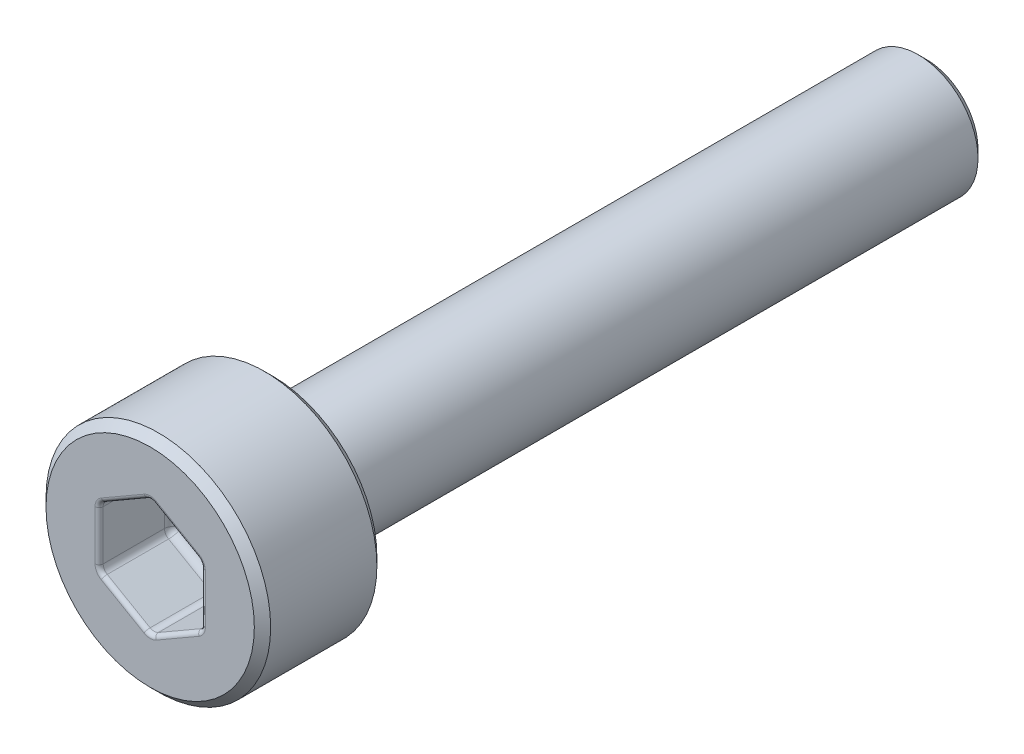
ISO-10303-21;
HEADER;
FILE_DESCRIPTION(('STEP AP214'),'2;1');
FILE_NAME('part.step','',(''),(''),'','','');
FILE_SCHEMA(('AUTOMOTIVE_DESIGN { 1 0 10303 214 1 1 1 1 }'));
ENDSEC;
DATA;
#1=APPLICATION_CONTEXT('core data for automotive mechanical design processes');
#2=APPLICATION_PROTOCOL_DEFINITION('international standard','automotive_design',2000,#1);
#3=PRODUCT_CONTEXT('',#1,'mechanical');
#4=PRODUCT('Part','Part','',(#3));
#5=PRODUCT_RELATED_PRODUCT_CATEGORY('part','',(#4));
#6=PRODUCT_DEFINITION_FORMATION('','',#4);
#7=PRODUCT_DEFINITION_CONTEXT('part definition',#1,'design');
#8=PRODUCT_DEFINITION('design','',#6,#7);
#9=PRODUCT_DEFINITION_SHAPE('','',#8);
#10=(LENGTH_UNIT() NAMED_UNIT(*) SI_UNIT(.MILLI.,.METRE.));
#11=(NAMED_UNIT(*) PLANE_ANGLE_UNIT() SI_UNIT($,.RADIAN.));
#12=(NAMED_UNIT(*) SI_UNIT($,.STERADIAN.) SOLID_ANGLE_UNIT());
#13=UNCERTAINTY_MEASURE_WITH_UNIT(LENGTH_MEASURE(1.E-05),#10,'distance_accuracy_value','');
#14=(GEOMETRIC_REPRESENTATION_CONTEXT(3) GLOBAL_UNCERTAINTY_ASSIGNED_CONTEXT((#13)) GLOBAL_UNIT_ASSIGNED_CONTEXT((#10,
#11,#12)) REPRESENTATION_CONTEXT('',''));
#15=CARTESIAN_POINT('',(0.,0.,0.));
#16=DIRECTION('',(0.,0.,1.));
#17=DIRECTION('',(1.,0.,0.));
#18=AXIS2_PLACEMENT_3D('',#15,#16,#17);
#19=CARTESIAN_POINT('',(0.,0.,3.));
#20=DIRECTION('',(0.,0.,-1.));
#21=DIRECTION('',(-1.,0.,0.));
#22=AXIS2_PLACEMENT_3D('',#19,#20,#21);
#23=PLANE('',#22);
#24=DIRECTION('',(0.,1.,0.));
#25=VECTOR('',#24,1.);
#26=CARTESIAN_POINT('',(1.35,0.,3.));
#27=LINE('',#26,#25);
#28=CARTESIAN_POINT('',(1.35,0.606217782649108,3.));
#29=VERTEX_POINT('',#28);
#30=CARTESIAN_POINT('',(1.35,-0.606217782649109,3.));
#31=VERTEX_POINT('',#30);
#32=EDGE_CURVE('E267',#29,#31,#27,.F.);
#33=ORIENTED_EDGE('',*,*,#32,.T.);
#34=CARTESIAN_POINT('',(1.05,-0.606217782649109,3.));
#35=DIRECTION('',(0.,0.,-1.));
#36=DIRECTION('',(-1.,0.,0.));
#37=AXIS2_PLACEMENT_3D('',#34,#35,#36);
#38=CIRCLE('',#37,0.3);
#39=CARTESIAN_POINT('',(1.2,-0.866025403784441,3.));
#40=VERTEX_POINT('',#39);
#41=EDGE_CURVE('E332',#31,#40,#38,.T.);
#42=ORIENTED_EDGE('',*,*,#41,.T.);
#43=DIRECTION('',(0.866025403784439,0.499999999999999,0.));
#44=VECTOR('',#43,1.);
#45=CARTESIAN_POINT('',(0.675,-1.16913429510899,3.));
#46=LINE('',#45,#44);
#47=CARTESIAN_POINT('',(0.15,-1.47224318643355,3.));
#48=VERTEX_POINT('',#47);
#49=EDGE_CURVE('E330',#40,#48,#46,.F.);
#50=ORIENTED_EDGE('',*,*,#49,.T.);
#51=CARTESIAN_POINT('',(0.,-1.21243556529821,3.));
#52=DIRECTION('',(0.,0.,-1.));
#53=DIRECTION('',(-1.,0.,0.));
#54=AXIS2_PLACEMENT_3D('',#51,#52,#53);
#55=CIRCLE('',#54,0.3);
#56=CARTESIAN_POINT('',(-0.15,-1.47224318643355,3.));
#57=VERTEX_POINT('',#56);
#58=EDGE_CURVE('E328',#48,#57,#55,.T.);
#59=ORIENTED_EDGE('',*,*,#58,.T.);
#60=DIRECTION('',(0.866025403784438,-0.500000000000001,0.));
#61=VECTOR('',#60,1.);
#62=CARTESIAN_POINT('',(-0.675000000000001,-1.16913429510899,3.));
#63=LINE('',#62,#61);
#64=CARTESIAN_POINT('',(-1.2,-0.866025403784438,3.));
#65=VERTEX_POINT('',#64);
#66=EDGE_CURVE('E326',#57,#65,#63,.F.);
#67=ORIENTED_EDGE('',*,*,#66,.T.);
#68=CARTESIAN_POINT('',(-1.05,-0.606217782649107,3.));
#69=DIRECTION('',(0.,0.,-1.));
#70=DIRECTION('',(-1.,0.,0.));
#71=AXIS2_PLACEMENT_3D('',#68,#69,#70);
#72=CIRCLE('',#71,0.3);
#73=CARTESIAN_POINT('',(-1.35,-0.606217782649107,3.));
#74=VERTEX_POINT('',#73);
#75=EDGE_CURVE('E324',#65,#74,#72,.T.);
#76=ORIENTED_EDGE('',*,*,#75,.T.);
#77=DIRECTION('',(0.,-1.,0.));
#78=VECTOR('',#77,1.);
#79=CARTESIAN_POINT('',(-1.35,0.,3.));
#80=LINE('',#79,#78);
#81=CARTESIAN_POINT('',(-1.35,0.606217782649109,3.));
#82=VERTEX_POINT('',#81);
#83=EDGE_CURVE('E322',#74,#82,#80,.F.);
#84=ORIENTED_EDGE('',*,*,#83,.T.);
#85=CARTESIAN_POINT('',(-1.05,0.606217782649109,3.));
#86=DIRECTION('',(0.,0.,-1.));
#87=DIRECTION('',(-1.,0.,0.));
#88=AXIS2_PLACEMENT_3D('',#85,#86,#87);
#89=CIRCLE('',#88,0.3);
#90=CARTESIAN_POINT('',(-1.2,0.86602540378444,3.));
#91=VERTEX_POINT('',#90);
#92=EDGE_CURVE('E320',#82,#91,#89,.T.);
#93=ORIENTED_EDGE('',*,*,#92,.T.);
#94=DIRECTION('',(-0.866025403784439,-0.5,0.));
#95=VECTOR('',#94,1.);
#96=CARTESIAN_POINT('',(-0.675,1.16913429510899,3.));
#97=LINE('',#96,#95);
#98=CARTESIAN_POINT('',(-0.149999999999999,1.47224318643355,3.));
#99=VERTEX_POINT('',#98);
#100=EDGE_CURVE('E318',#91,#99,#97,.F.);
#101=ORIENTED_EDGE('',*,*,#100,.T.);
#102=CARTESIAN_POINT('',(0.,1.21243556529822,3.));
#103=DIRECTION('',(0.,0.,-1.));
#104=DIRECTION('',(-1.,0.,0.));
#105=AXIS2_PLACEMENT_3D('',#102,#103,#104);
#106=CIRCLE('',#105,0.3);
#107=CARTESIAN_POINT('',(0.150000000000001,1.47224318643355,3.));
#108=VERTEX_POINT('',#107);
#109=EDGE_CURVE('E316',#99,#108,#106,.T.);
#110=ORIENTED_EDGE('',*,*,#109,.T.);
#111=DIRECTION('',(-0.866025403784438,0.5,0.));
#112=VECTOR('',#111,1.);
#113=CARTESIAN_POINT('',(0.675000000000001,1.16913429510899,3.));
#114=LINE('',#113,#112);
#115=CARTESIAN_POINT('',(1.2,0.86602540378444,3.));
#116=VERTEX_POINT('',#115);
#117=EDGE_CURVE('E314',#108,#116,#114,.F.);
#118=ORIENTED_EDGE('',*,*,#117,.T.);
#119=CARTESIAN_POINT('',(1.05,0.606217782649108,3.));
#120=DIRECTION('',(0.,0.,-1.));
#121=DIRECTION('',(-1.,0.,0.));
#122=AXIS2_PLACEMENT_3D('',#119,#120,#121);
#123=CIRCLE('',#122,0.3);
#124=EDGE_CURVE('E312',#116,#29,#123,.T.);
#125=ORIENTED_EDGE('',*,*,#124,.T.);
#126=EDGE_LOOP('',(#33,#42,#50,#59,#67,#76,#84,#93,#101,#110,#118,#125));
#127=FACE_BOUND('',#126,.T.);
#128=CARTESIAN_POINT('',(0.,0.,3.));
#129=DIRECTION('',(0.,0.,-1.));
#130=DIRECTION('',(-1.,0.,0.));
#131=AXIS2_PLACEMENT_3D('',#128,#129,#130);
#132=CIRCLE('',#131,2.55000000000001);
#133=CARTESIAN_POINT('',(-2.55000000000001,0.,3.));
#134=VERTEX_POINT('',#133);
#135=EDGE_CURVE('E310',#134,#134,#132,.F.);
#136=ORIENTED_EDGE('',*,*,#135,.T.);
#137=EDGE_LOOP('',(#136));
#138=FACE_BOUND('',#137,.T.);
#139=ADVANCED_FACE('F38',(#127,#138),#23,.F.);
#140=CARTESIAN_POINT('',(0.,0.,21.9198795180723));
#141=DIRECTION('',(0.,0.,1.));
#142=DIRECTION('',(1.,0.,0.));
#143=AXIS2_PLACEMENT_3D('',#140,#141,#142);
#144=CYLINDRICAL_SURFACE('',#143,2.75);
#145=CARTESIAN_POINT('',(0.,0.,2.8));
#146=DIRECTION('',(0.,0.,-1.));
#147=DIRECTION('',(-1.,0.,0.));
#148=AXIS2_PLACEMENT_3D('',#145,#146,#147);
#149=CIRCLE('',#148,2.75);
#150=CARTESIAN_POINT('',(-2.75,0.,2.8));
#151=VERTEX_POINT('',#150);
#152=EDGE_CURVE('E872',#151,#151,#149,.T.);
#153=ORIENTED_EDGE('',*,*,#152,.T.);
#154=EDGE_LOOP('',(#153));
#155=FACE_BOUND('',#154,.T.);
#156=CARTESIAN_POINT('',(0.,0.,0.200000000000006));
#157=DIRECTION('',(0.,0.,1.));
#158=DIRECTION('',(1.,0.,0.));
#159=AXIS2_PLACEMENT_3D('',#156,#157,#158);
#160=CIRCLE('',#159,2.75);
#161=CARTESIAN_POINT('',(2.75,0.,0.200000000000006));
#162=VERTEX_POINT('',#161);
#163=EDGE_CURVE('E877',#162,#162,#160,.T.);
#164=ORIENTED_EDGE('',*,*,#163,.T.);
#165=EDGE_LOOP('',(#164));
#166=FACE_BOUND('',#165,.T.);
#167=ADVANCED_FACE('F431',(#155,#166),#144,.T.);
#168=CARTESIAN_POINT('',(0.,2.75,0.));
#169=DIRECTION('',(0.,0.,1.));
#170=DIRECTION('',(1.,0.,0.));
#171=AXIS2_PLACEMENT_3D('',#168,#169,#170);
#172=PLANE('',#171);
#173=CARTESIAN_POINT('',(0.,0.,0.));
#174=DIRECTION('',(0.,0.,1.));
#175=DIRECTION('',(1.,0.,0.));
#176=AXIS2_PLACEMENT_3D('',#173,#174,#175);
#177=CIRCLE('',#176,1.665);
#178=CARTESIAN_POINT('',(1.665,0.,0.));
#179=VERTEX_POINT('',#178);
#180=EDGE_CURVE('E262',#179,#179,#177,.T.);
#181=ORIENTED_EDGE('',*,*,#180,.T.);
#182=EDGE_LOOP('',(#181));
#183=FACE_BOUND('',#182,.T.);
#184=CARTESIAN_POINT('',(0.,0.,0.));
#185=DIRECTION('',(0.,0.,1.));
#186=DIRECTION('',(1.,0.,0.));
#187=AXIS2_PLACEMENT_3D('',#184,#185,#186);
#188=CIRCLE('',#187,2.54999999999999);
#189=CARTESIAN_POINT('',(2.54999999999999,0.,0.));
#190=VERTEX_POINT('',#189);
#191=EDGE_CURVE('E870',#190,#190,#188,.F.);
#192=ORIENTED_EDGE('',*,*,#191,.T.);
#193=EDGE_LOOP('',(#192));
#194=FACE_BOUND('',#193,.T.);
#195=ADVANCED_FACE('F437',(#183,#194),#172,.F.);
#196=CARTESIAN_POINT('',(0.,0.,21.9198795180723));
#197=DIRECTION('',(0.,0.,1.));
#198=DIRECTION('',(1.,0.,0.));
#199=AXIS2_PLACEMENT_3D('',#196,#197,#198);
#200=CYLINDRICAL_SURFACE('',#199,1.465);
#201=CARTESIAN_POINT('',(0.,0.,-0.200000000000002));
#202=DIRECTION('',(0.,0.,1.));
#203=DIRECTION('',(1.,0.,0.));
#204=AXIS2_PLACEMENT_3D('',#201,#202,#203);
#205=CIRCLE('',#204,1.465);
#206=CARTESIAN_POINT('',(1.465,0.,-0.200000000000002));
#207=VERTEX_POINT('',#206);
#208=EDGE_CURVE('E265',#207,#207,#205,.F.);
#209=ORIENTED_EDGE('',*,*,#208,.T.);
#210=EDGE_LOOP('',(#209));
#211=FACE_BOUND('',#210,.T.);
#212=CARTESIAN_POINT('',(0.,0.,-15.8));
#213=DIRECTION('',(0.,0.,1.));
#214=DIRECTION('',(1.,0.,0.));
#215=AXIS2_PLACEMENT_3D('',#212,#213,#214);
#216=CIRCLE('',#215,1.465);
#217=CARTESIAN_POINT('',(1.465,0.,-15.8));
#218=VERTEX_POINT('',#217);
#219=EDGE_CURVE('E871',#218,#218,#216,.T.);
#220=ORIENTED_EDGE('',*,*,#219,.T.);
#221=EDGE_LOOP('',(#220));
#222=FACE_BOUND('',#221,.T.);
#223=ADVANCED_FACE('F812',(#211,#222),#200,.T.);
#224=CARTESIAN_POINT('',(0.,1.465,-16.));
#225=DIRECTION('',(0.,0.,1.));
#226=DIRECTION('',(1.,0.,0.));
#227=AXIS2_PLACEMENT_3D('',#224,#225,#226);
#228=PLANE('',#227);
#229=CARTESIAN_POINT('',(0.,0.,-16.));
#230=DIRECTION('',(0.,0.,1.));
#231=DIRECTION('',(1.,0.,0.));
#232=AXIS2_PLACEMENT_3D('',#229,#230,#231);
#233=CIRCLE('',#232,1.265);
#234=CARTESIAN_POINT('',(1.265,0.,-16.));
#235=VERTEX_POINT('',#234);
#236=EDGE_CURVE('E212',#235,#235,#233,.F.);
#237=ORIENTED_EDGE('',*,*,#236,.T.);
#238=EDGE_LOOP('',(#237));
#239=FACE_BOUND('',#238,.T.);
#240=ADVANCED_FACE('F804',(#239),#228,.F.);
#241=CARTESIAN_POINT('',(0.,-1.44337567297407,1.2));
#242=DIRECTION('',(0.499999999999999,-0.866025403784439,0.));
#243=DIRECTION('',(0.866025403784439,0.499999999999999,0.));
#244=AXIS2_PLACEMENT_3D('',#241,#242,#243);
#245=PLANE('',#244);
#246=DIRECTION('',(0.,0.,1.));
#247=VECTOR('',#246,1.);
#248=CARTESIAN_POINT('',(0.0999999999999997,-1.3856406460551,3.));
#249=LINE('',#248,#247);
#250=CARTESIAN_POINT('',(0.0999999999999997,-1.3856406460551,1.4));
#251=VERTEX_POINT('',#250);
#252=CARTESIAN_POINT('',(0.0999999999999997,-1.3856406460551,2.9));
#253=VERTEX_POINT('',#252);
#254=EDGE_CURVE('E259',#251,#253,#249,.T.);
#255=ORIENTED_EDGE('',*,*,#254,.T.);
#256=DIRECTION('',(0.866025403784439,0.499999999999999,0.));
#257=VECTOR('',#256,1.);
#258=CARTESIAN_POINT('',(0.,-1.44337567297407,2.9));
#259=LINE('',#258,#257);
#260=CARTESIAN_POINT('',(1.15,-0.779422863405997,2.9));
#261=VERTEX_POINT('',#260);
#262=EDGE_CURVE('E338',#253,#261,#259,.T.);
#263=ORIENTED_EDGE('',*,*,#262,.T.);
#264=DIRECTION('',(0.,0.,1.));
#265=VECTOR('',#264,1.);
#266=CARTESIAN_POINT('',(1.15,-0.779422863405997,1.2));
#267=LINE('',#266,#265);
#268=CARTESIAN_POINT('',(1.15,-0.779422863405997,1.4));
#269=VERTEX_POINT('',#268);
#270=EDGE_CURVE('E255',#261,#269,#267,.F.);
#271=ORIENTED_EDGE('',*,*,#270,.T.);
#272=DIRECTION('',(0.866025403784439,0.499999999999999,0.));
#273=VECTOR('',#272,1.);
#274=CARTESIAN_POINT('',(0.,-1.44337567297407,1.4));
#275=LINE('',#274,#273);
#276=EDGE_CURVE('E257',#269,#251,#275,.F.);
#277=ORIENTED_EDGE('',*,*,#276,.T.);
#278=EDGE_LOOP('',(#255,#263,#271,#277));
#279=FACE_BOUND('',#278,.T.);
#280=ADVANCED_FACE('F795',(#279),#245,.F.);
#281=CARTESIAN_POINT('',(-1.25,-0.721687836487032,1.2));
#282=DIRECTION('',(-0.5,-0.866025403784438,0.));
#283=DIRECTION('',(0.866025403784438,-0.500000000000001,0.));
#284=AXIS2_PLACEMENT_3D('',#281,#282,#283);
#285=PLANE('',#284);
#286=DIRECTION('',(0.,0.,1.));
#287=VECTOR('',#286,1.);
#288=CARTESIAN_POINT('',(-1.15,-0.779422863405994,3.));
#289=LINE('',#288,#287);
#290=CARTESIAN_POINT('',(-1.15,-0.779422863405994,1.4));
#291=VERTEX_POINT('',#290);
#292=CARTESIAN_POINT('',(-1.15,-0.779422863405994,2.9));
#293=VERTEX_POINT('',#292);
#294=EDGE_CURVE('E226',#291,#293,#289,.T.);
#295=ORIENTED_EDGE('',*,*,#294,.T.);
#296=DIRECTION('',(0.866025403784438,-0.500000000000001,0.));
#297=VECTOR('',#296,1.);
#298=CARTESIAN_POINT('',(-1.25,-0.721687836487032,2.9));
#299=LINE('',#298,#297);
#300=CARTESIAN_POINT('',(-0.1,-1.3856406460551,2.9));
#301=VERTEX_POINT('',#300);
#302=EDGE_CURVE('E342',#293,#301,#299,.T.);
#303=ORIENTED_EDGE('',*,*,#302,.T.);
#304=DIRECTION('',(0.,0.,1.));
#305=VECTOR('',#304,1.);
#306=CARTESIAN_POINT('',(-0.1,-1.3856406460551,1.2));
#307=LINE('',#306,#305);
#308=CARTESIAN_POINT('',(-0.1,-1.3856406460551,1.4));
#309=VERTEX_POINT('',#308);
#310=EDGE_CURVE('E218',#301,#309,#307,.F.);
#311=ORIENTED_EDGE('',*,*,#310,.T.);
#312=DIRECTION('',(0.866025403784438,-0.500000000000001,0.));
#313=VECTOR('',#312,1.);
#314=CARTESIAN_POINT('',(-1.25,-0.721687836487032,1.4));
#315=LINE('',#314,#313);
#316=EDGE_CURVE('E189',#309,#291,#315,.F.);
#317=ORIENTED_EDGE('',*,*,#316,.T.);
#318=EDGE_LOOP('',(#295,#303,#311,#317));
#319=FACE_BOUND('',#318,.T.);
#320=ADVANCED_FACE('F787',(#319),#285,.F.);
#321=CARTESIAN_POINT('',(-1.25,0.721687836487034,1.2));
#322=DIRECTION('',(-1.,0.,0.));
#323=DIRECTION('',(0.,-1.,0.));
#324=AXIS2_PLACEMENT_3D('',#321,#322,#323);
#325=PLANE('',#324);
#326=DIRECTION('',(0.,0.,1.));
#327=VECTOR('',#326,1.);
#328=CARTESIAN_POINT('',(-1.25,0.606217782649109,3.));
#329=LINE('',#328,#327);
#330=CARTESIAN_POINT('',(-1.25,0.606217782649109,1.4));
#331=VERTEX_POINT('',#330);
#332=CARTESIAN_POINT('',(-1.25,0.606217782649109,2.9));
#333=VERTEX_POINT('',#332);
#334=EDGE_CURVE('E229',#331,#333,#329,.T.);
#335=ORIENTED_EDGE('',*,*,#334,.T.);
#336=DIRECTION('',(0.,-1.,0.));
#337=VECTOR('',#336,1.);
#338=CARTESIAN_POINT('',(-1.25,0.721687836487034,2.9));
#339=LINE('',#338,#337);
#340=CARTESIAN_POINT('',(-1.25,-0.606217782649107,2.9));
#341=VERTEX_POINT('',#340);
#342=EDGE_CURVE('E346',#333,#341,#339,.T.);
#343=ORIENTED_EDGE('',*,*,#342,.T.);
#344=DIRECTION('',(0.,0.,1.));
#345=VECTOR('',#344,1.);
#346=CARTESIAN_POINT('',(-1.25,-0.606217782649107,1.2));
#347=LINE('',#346,#345);
#348=CARTESIAN_POINT('',(-1.25,-0.606217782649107,1.4));
#349=VERTEX_POINT('',#348);
#350=EDGE_CURVE('E234',#341,#349,#347,.F.);
#351=ORIENTED_EDGE('',*,*,#350,.T.);
#352=DIRECTION('',(0.,-1.,0.));
#353=VECTOR('',#352,1.);
#354=CARTESIAN_POINT('',(-1.25,0.721687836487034,1.4));
#355=LINE('',#354,#353);
#356=EDGE_CURVE('E232',#349,#331,#355,.F.);
#357=ORIENTED_EDGE('',*,*,#356,.T.);
#358=EDGE_LOOP('',(#335,#343,#351,#357));
#359=FACE_BOUND('',#358,.T.);
#360=ADVANCED_FACE('F406',(#359),#325,.F.);
#361=CARTESIAN_POINT('',(0.,1.44337567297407,1.2));
#362=DIRECTION('',(-0.5,0.866025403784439,0.));
#363=DIRECTION('',(-0.866025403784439,-0.5,0.));
#364=AXIS2_PLACEMENT_3D('',#361,#362,#363);
#365=PLANE('',#364);
#366=DIRECTION('',(0.,0.,1.));
#367=VECTOR('',#366,1.);
#368=CARTESIAN_POINT('',(-0.0999999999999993,1.3856406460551,3.));
#369=LINE('',#368,#367);
#370=CARTESIAN_POINT('',(-0.0999999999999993,1.3856406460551,1.4));
#371=VERTEX_POINT('',#370);
#372=CARTESIAN_POINT('',(-0.0999999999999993,1.3856406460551,2.9));
#373=VERTEX_POINT('',#372);
#374=EDGE_CURVE('E240',#371,#373,#369,.T.);
#375=ORIENTED_EDGE('',*,*,#374,.T.);
#376=DIRECTION('',(-0.866025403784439,-0.5,0.));
#377=VECTOR('',#376,1.);
#378=CARTESIAN_POINT('',(0.,1.44337567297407,2.9));
#379=LINE('',#378,#377);
#380=CARTESIAN_POINT('',(-1.15,0.779422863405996,2.9));
#381=VERTEX_POINT('',#380);
#382=EDGE_CURVE('E350',#373,#381,#379,.T.);
#383=ORIENTED_EDGE('',*,*,#382,.T.);
#384=DIRECTION('',(0.,0.,1.));
#385=VECTOR('',#384,1.);
#386=CARTESIAN_POINT('',(-1.15,0.779422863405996,1.2));
#387=LINE('',#386,#385);
#388=CARTESIAN_POINT('',(-1.15,0.779422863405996,1.4));
#389=VERTEX_POINT('',#388);
#390=EDGE_CURVE('E236',#381,#389,#387,.F.);
#391=ORIENTED_EDGE('',*,*,#390,.T.);
#392=DIRECTION('',(-0.866025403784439,-0.5,0.));
#393=VECTOR('',#392,1.);
#394=CARTESIAN_POINT('',(0.,1.44337567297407,1.4));
#395=LINE('',#394,#393);
#396=EDGE_CURVE('E238',#389,#371,#395,.F.);
#397=ORIENTED_EDGE('',*,*,#396,.T.);
#398=EDGE_LOOP('',(#375,#383,#391,#397));
#399=FACE_BOUND('',#398,.T.);
#400=ADVANCED_FACE('F770',(#399),#365,.F.);
#401=CARTESIAN_POINT('',(1.25,0.721687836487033,1.2));
#402=DIRECTION('',(0.5,0.866025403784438,0.));
#403=DIRECTION('',(-0.866025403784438,0.5,0.));
#404=AXIS2_PLACEMENT_3D('',#401,#402,#403);
#405=PLANE('',#404);
#406=DIRECTION('',(0.,0.,1.));
#407=VECTOR('',#406,1.);
#408=CARTESIAN_POINT('',(1.15,0.779422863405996,3.));
#409=LINE('',#408,#407);
#410=CARTESIAN_POINT('',(1.15,0.779422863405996,1.4));
#411=VERTEX_POINT('',#410);
#412=CARTESIAN_POINT('',(1.15,0.779422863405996,2.9));
#413=VERTEX_POINT('',#412);
#414=EDGE_CURVE('E247',#411,#413,#409,.T.);
#415=ORIENTED_EDGE('',*,*,#414,.T.);
#416=DIRECTION('',(-0.866025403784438,0.5,0.));
#417=VECTOR('',#416,1.);
#418=CARTESIAN_POINT('',(1.25,0.721687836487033,2.9));
#419=LINE('',#418,#417);
#420=CARTESIAN_POINT('',(0.100000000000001,1.3856406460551,2.9));
#421=VERTEX_POINT('',#420);
#422=EDGE_CURVE('E354',#413,#421,#419,.T.);
#423=ORIENTED_EDGE('',*,*,#422,.T.);
#424=DIRECTION('',(0.,0.,1.));
#425=VECTOR('',#424,1.);
#426=CARTESIAN_POINT('',(0.100000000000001,1.3856406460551,1.2));
#427=LINE('',#426,#425);
#428=CARTESIAN_POINT('',(0.100000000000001,1.3856406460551,1.4));
#429=VERTEX_POINT('',#428);
#430=EDGE_CURVE('E243',#421,#429,#427,.F.);
#431=ORIENTED_EDGE('',*,*,#430,.T.);
#432=DIRECTION('',(-0.866025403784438,0.5,0.));
#433=VECTOR('',#432,1.);
#434=CARTESIAN_POINT('',(1.25,0.721687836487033,1.4));
#435=LINE('',#434,#433);
#436=EDGE_CURVE('E245',#429,#411,#435,.F.);
#437=ORIENTED_EDGE('',*,*,#436,.T.);
#438=EDGE_LOOP('',(#415,#423,#431,#437));
#439=FACE_BOUND('',#438,.T.);
#440=ADVANCED_FACE('F762',(#439),#405,.F.);
#441=CARTESIAN_POINT('',(1.25,-0.721687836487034,1.2));
#442=DIRECTION('',(1.,0.,0.));
#443=DIRECTION('',(0.,1.,0.));
#444=AXIS2_PLACEMENT_3D('',#441,#442,#443);
#445=PLANE('',#444);
#446=DIRECTION('',(0.,0.,1.));
#447=VECTOR('',#446,1.);
#448=CARTESIAN_POINT('',(1.25,-0.606217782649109,3.));
#449=LINE('',#448,#447);
#450=CARTESIAN_POINT('',(1.25,-0.606217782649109,1.4));
#451=VERTEX_POINT('',#450);
#452=CARTESIAN_POINT('',(1.25,-0.606217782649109,2.9));
#453=VERTEX_POINT('',#452);
#454=EDGE_CURVE('E253',#451,#453,#449,.T.);
#455=ORIENTED_EDGE('',*,*,#454,.T.);
#456=DIRECTION('',(0.,1.,0.));
#457=VECTOR('',#456,1.);
#458=CARTESIAN_POINT('',(1.25,-0.721687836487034,2.9));
#459=LINE('',#458,#457);
#460=CARTESIAN_POINT('',(1.25,0.606217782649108,2.9));
#461=VERTEX_POINT('',#460);
#462=EDGE_CURVE('E11',#453,#461,#459,.T.);
#463=ORIENTED_EDGE('',*,*,#462,.T.);
#464=DIRECTION('',(0.,0.,1.));
#465=VECTOR('',#464,1.);
#466=CARTESIAN_POINT('',(1.25,0.606217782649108,1.2));
#467=LINE('',#466,#465);
#468=CARTESIAN_POINT('',(1.25,0.606217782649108,1.4));
#469=VERTEX_POINT('',#468);
#470=EDGE_CURVE('E249',#461,#469,#467,.F.);
#471=ORIENTED_EDGE('',*,*,#470,.T.);
#472=DIRECTION('',(0.,1.,0.));
#473=VECTOR('',#472,1.);
#474=CARTESIAN_POINT('',(1.25,-0.721687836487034,1.4));
#475=LINE('',#474,#473);
#476=EDGE_CURVE('E251',#469,#451,#475,.F.);
#477=ORIENTED_EDGE('',*,*,#476,.T.);
#478=EDGE_LOOP('',(#455,#463,#471,#477));
#479=FACE_BOUND('',#478,.T.);
#480=ADVANCED_FACE('F754',(#479),#445,.F.);
#481=CARTESIAN_POINT('',(0.,0.,1.2));
#482=DIRECTION('',(0.,0.,1.));
#483=DIRECTION('',(1.,0.,0.));
#484=AXIS2_PLACEMENT_3D('',#481,#482,#483);
#485=PLANE('',#484);
#486=DIRECTION('',(0.,-1.,0.));
#487=VECTOR('',#486,1.);
#488=CARTESIAN_POINT('',(-1.05,0.,1.2));
#489=LINE('',#488,#487);
#490=CARTESIAN_POINT('',(-1.05,0.606217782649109,1.2));
#491=VERTEX_POINT('',#490);
#492=CARTESIAN_POINT('',(-1.05,-0.606217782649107,1.2));
#493=VERTEX_POINT('',#492);
#494=EDGE_CURVE('E216',#491,#493,#489,.T.);
#495=ORIENTED_EDGE('',*,*,#494,.T.);
#496=DIRECTION('',(0.866025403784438,-0.500000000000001,0.));
#497=VECTOR('',#496,1.);
#498=CARTESIAN_POINT('',(-0.525000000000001,-0.909326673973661,1.2));
#499=LINE('',#498,#497);
#500=CARTESIAN_POINT('',(0.,-1.21243556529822,1.2));
#501=VERTEX_POINT('',#500);
#502=EDGE_CURVE('E187',#493,#501,#499,.T.);
#503=ORIENTED_EDGE('',*,*,#502,.T.);
#504=DIRECTION('',(0.866025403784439,0.499999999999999,0.));
#505=VECTOR('',#504,1.);
#506=CARTESIAN_POINT('',(0.525,-0.909326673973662,1.2));
#507=LINE('',#506,#505);
#508=CARTESIAN_POINT('',(1.05,-0.606217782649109,1.2));
#509=VERTEX_POINT('',#508);
#510=EDGE_CURVE('E205',#501,#509,#507,.T.);
#511=ORIENTED_EDGE('',*,*,#510,.T.);
#512=DIRECTION('',(0.,1.,0.));
#513=VECTOR('',#512,1.);
#514=CARTESIAN_POINT('',(1.05,0.,1.2));
#515=LINE('',#514,#513);
#516=CARTESIAN_POINT('',(1.05,0.606217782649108,1.2));
#517=VERTEX_POINT('',#516);
#518=EDGE_CURVE('E211',#509,#517,#515,.T.);
#519=ORIENTED_EDGE('',*,*,#518,.T.);
#520=DIRECTION('',(-0.866025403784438,0.5,0.));
#521=VECTOR('',#520,1.);
#522=CARTESIAN_POINT('',(0.525000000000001,0.909326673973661,1.2));
#523=LINE('',#522,#521);
#524=CARTESIAN_POINT('',(0.,1.21243556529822,1.2));
#525=VERTEX_POINT('',#524);
#526=EDGE_CURVE('E884',#517,#525,#523,.T.);
#527=ORIENTED_EDGE('',*,*,#526,.T.);
#528=DIRECTION('',(-0.866025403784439,-0.5,0.));
#529=VECTOR('',#528,1.);
#530=CARTESIAN_POINT('',(-0.525,0.909326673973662,1.2));
#531=LINE('',#530,#529);
#532=EDGE_CURVE('E221',#525,#491,#531,.T.);
#533=ORIENTED_EDGE('',*,*,#532,.T.);
#534=EDGE_LOOP('',(#495,#503,#511,#519,#527,#533));
#535=FACE_BOUND('',#534,.T.);
#536=ADVANCED_FACE('F214',(#535),#485,.T.);
#537=CARTESIAN_POINT('',(0.,0.,3.));
#538=DIRECTION('',(0.,0.,-1.));
#539=DIRECTION('',(-1.,0.,0.));
#540=AXIS2_PLACEMENT_3D('',#537,#538,#539);
#541=CONICAL_SURFACE('',#540,2.55000000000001,0.785398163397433);
#542=ORIENTED_EDGE('',*,*,#152,.F.);
#543=EDGE_LOOP('',(#542));
#544=FACE_BOUND('',#543,.T.);
#545=ORIENTED_EDGE('',*,*,#135,.F.);
#546=EDGE_LOOP('',(#545));
#547=FACE_BOUND('',#546,.T.);
#548=ADVANCED_FACE('F443',(#544,#547),#541,.T.);
#549=CARTESIAN_POINT('',(0.,0.,0.200000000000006));
#550=DIRECTION('',(0.,0.,1.));
#551=DIRECTION('',(1.,0.,0.));
#552=AXIS2_PLACEMENT_3D('',#549,#550,#551);
#553=CONICAL_SURFACE('',#552,2.75,0.785398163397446);
#554=ORIENTED_EDGE('',*,*,#191,.F.);
#555=EDGE_LOOP('',(#554));
#556=FACE_BOUND('',#555,.T.);
#557=ORIENTED_EDGE('',*,*,#163,.F.);
#558=EDGE_LOOP('',(#557));
#559=FACE_BOUND('',#558,.T.);
#560=ADVANCED_FACE('F446',(#556,#559),#553,.T.);
#561=CARTESIAN_POINT('',(0.,0.,-15.8));
#562=DIRECTION('',(0.,0.,1.));
#563=DIRECTION('',(1.,0.,0.));
#564=AXIS2_PLACEMENT_3D('',#561,#562,#563);
#565=CONICAL_SURFACE('',#564,1.465,0.785398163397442);
#566=ORIENTED_EDGE('',*,*,#236,.F.);
#567=EDGE_LOOP('',(#566));
#568=FACE_BOUND('',#567,.T.);
#569=ORIENTED_EDGE('',*,*,#219,.F.);
#570=EDGE_LOOP('',(#569));
#571=FACE_BOUND('',#570,.T.);
#572=ADVANCED_FACE('F450',(#568,#571),#565,.T.);
#573=CARTESIAN_POINT('',(0.,1.21243556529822,1.2));
#574=DIRECTION('',(0.,0.,-1.));
#575=DIRECTION('',(-1.,0.,0.));
#576=AXIS2_PLACEMENT_3D('',#573,#574,#575);
#577=CYLINDRICAL_SURFACE('',#576,0.2);
#578=ORIENTED_EDGE('',*,*,#430,.F.);
#579=CARTESIAN_POINT('',(0.,1.21243556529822,2.9));
#580=DIRECTION('',(0.,0.,-1.));
#581=DIRECTION('',(-1.,0.,0.));
#582=AXIS2_PLACEMENT_3D('',#579,#580,#581);
#583=CIRCLE('',#582,0.2);
#584=EDGE_CURVE('E352',#421,#373,#583,.F.);
#585=ORIENTED_EDGE('',*,*,#584,.T.);
#586=ORIENTED_EDGE('',*,*,#374,.F.);
#587=CARTESIAN_POINT('',(0.,1.21243556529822,1.4));
#588=DIRECTION('',(0.,0.,1.));
#589=DIRECTION('',(1.,0.,0.));
#590=AXIS2_PLACEMENT_3D('',#587,#588,#589);
#591=CIRCLE('',#590,0.2);
#592=EDGE_CURVE('E307',#429,#371,#591,.T.);
#593=ORIENTED_EDGE('',*,*,#592,.F.);
#594=EDGE_LOOP('',(#578,#585,#586,#593));
#595=FACE_BOUND('',#594,.T.);
#596=ADVANCED_FACE('F454',(#595),#577,.F.);
#597=CARTESIAN_POINT('',(0.525000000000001,0.909326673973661,1.4));
#598=DIRECTION('',(-0.866025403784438,0.5,0.));
#599=DIRECTION('',(-0.5,-0.866025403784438,0.));
#600=AXIS2_PLACEMENT_3D('',#597,#598,#599);
#601=CYLINDRICAL_SURFACE('',#600,0.2);
#602=CARTESIAN_POINT('',(1.05,0.606217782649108,1.4));
#603=DIRECTION('',(-0.866025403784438,0.5,0.));
#604=DIRECTION('',(-0.5,-0.866025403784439,0.));
#605=AXIS2_PLACEMENT_3D('',#602,#603,#604);
#606=CIRCLE('',#605,0.2);
#607=EDGE_CURVE('E301',#411,#517,#606,.T.);
#608=ORIENTED_EDGE('',*,*,#607,.F.);
#609=ORIENTED_EDGE('',*,*,#436,.F.);
#610=CARTESIAN_POINT('',(0.,1.21243556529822,1.4));
#611=DIRECTION('',(0.866025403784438,-0.500000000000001,0.));
#612=DIRECTION('',(0.500000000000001,0.866025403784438,0.));
#613=AXIS2_PLACEMENT_3D('',#610,#611,#612);
#614=CIRCLE('',#613,0.2);
#615=EDGE_CURVE('E304',#525,#429,#614,.T.);
#616=ORIENTED_EDGE('',*,*,#615,.F.);
#617=ORIENTED_EDGE('',*,*,#526,.F.);
#618=EDGE_LOOP('',(#608,#609,#616,#617));
#619=FACE_BOUND('',#618,.T.);
#620=ADVANCED_FACE('F715',(#619),#601,.F.);
#621=CARTESIAN_POINT('',(1.05,0.606217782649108,1.2));
#622=DIRECTION('',(0.,0.,-1.));
#623=DIRECTION('',(-1.,0.,0.));
#624=AXIS2_PLACEMENT_3D('',#621,#622,#623);
#625=CYLINDRICAL_SURFACE('',#624,0.2);
#626=ORIENTED_EDGE('',*,*,#470,.F.);
#627=CARTESIAN_POINT('',(1.05,0.606217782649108,2.9));
#628=DIRECTION('',(0.,0.,-1.));
#629=DIRECTION('',(-1.,0.,0.));
#630=AXIS2_PLACEMENT_3D('',#627,#628,#629);
#631=CIRCLE('',#630,0.2);
#632=EDGE_CURVE('E47',#461,#413,#631,.F.);
#633=ORIENTED_EDGE('',*,*,#632,.T.);
#634=ORIENTED_EDGE('',*,*,#414,.F.);
#635=CARTESIAN_POINT('',(1.05,0.606217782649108,1.4));
#636=DIRECTION('',(0.,0.,1.));
#637=DIRECTION('',(1.,0.,0.));
#638=AXIS2_PLACEMENT_3D('',#635,#636,#637);
#639=CIRCLE('',#638,0.2);
#640=EDGE_CURVE('E298',#469,#411,#639,.T.);
#641=ORIENTED_EDGE('',*,*,#640,.F.);
#642=EDGE_LOOP('',(#626,#633,#634,#641));
#643=FACE_BOUND('',#642,.T.);
#644=ADVANCED_FACE('F706',(#643),#625,.F.);
#645=CARTESIAN_POINT('',(0.,1.21243556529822,1.4));
#646=DIRECTION('',(0.,0.,1.));
#647=DIRECTION('',(1.,0.,0.));
#648=AXIS2_PLACEMENT_3D('',#645,#646,#647);
#649=SPHERICAL_SURFACE('',#648,0.2);
#650=ORIENTED_EDGE('',*,*,#615,.T.);
#651=ORIENTED_EDGE('',*,*,#592,.T.);
#652=CARTESIAN_POINT('',(0.,1.21243556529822,1.4));
#653=DIRECTION('',(-0.866025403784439,-0.5,0.));
#654=DIRECTION('',(0.5,-0.866025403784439,0.));
#655=AXIS2_PLACEMENT_3D('',#652,#653,#654);
#656=CIRCLE('',#655,0.2);
#657=EDGE_CURVE('E295',#525,#371,#656,.F.);
#658=ORIENTED_EDGE('',*,*,#657,.F.);
#659=EDGE_LOOP('',(#650,#651,#658));
#660=FACE_BOUND('',#659,.T.);
#661=ADVANCED_FACE('F697',(#660),#649,.F.);
#662=CARTESIAN_POINT('',(1.05,0.606217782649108,1.4));
#663=DIRECTION('',(0.,0.,1.));
#664=DIRECTION('',(1.,0.,0.));
#665=AXIS2_PLACEMENT_3D('',#662,#663,#664);
#666=SPHERICAL_SURFACE('',#665,0.2);
#667=ORIENTED_EDGE('',*,*,#640,.T.);
#668=ORIENTED_EDGE('',*,*,#607,.T.);
#669=CARTESIAN_POINT('',(1.05,0.606217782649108,1.4));
#670=DIRECTION('',(0.,-1.,0.));
#671=DIRECTION('',(0.,0.,-1.));
#672=AXIS2_PLACEMENT_3D('',#669,#670,#671);
#673=CIRCLE('',#672,0.2);
#674=EDGE_CURVE('E292',#469,#517,#673,.F.);
#675=ORIENTED_EDGE('',*,*,#674,.F.);
#676=EDGE_LOOP('',(#667,#668,#675));
#677=FACE_BOUND('',#676,.T.);
#678=ADVANCED_FACE('F689',(#677),#666,.F.);
#679=CARTESIAN_POINT('',(-1.05,0.606217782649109,1.2));
#680=DIRECTION('',(0.,0.,-1.));
#681=DIRECTION('',(-1.,0.,0.));
#682=AXIS2_PLACEMENT_3D('',#679,#680,#681);
#683=CYLINDRICAL_SURFACE('',#682,0.2);
#684=ORIENTED_EDGE('',*,*,#390,.F.);
#685=CARTESIAN_POINT('',(-1.05,0.606217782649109,2.9));
#686=DIRECTION('',(0.,0.,-1.));
#687=DIRECTION('',(-1.,0.,0.));
#688=AXIS2_PLACEMENT_3D('',#685,#686,#687);
#689=CIRCLE('',#688,0.2);
#690=EDGE_CURVE('E348',#381,#333,#689,.F.);
#691=ORIENTED_EDGE('',*,*,#690,.T.);
#692=ORIENTED_EDGE('',*,*,#334,.F.);
#693=CARTESIAN_POINT('',(-1.05,0.606217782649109,1.4));
#694=DIRECTION('',(0.,0.,1.));
#695=DIRECTION('',(1.,0.,0.));
#696=AXIS2_PLACEMENT_3D('',#693,#694,#695);
#697=CIRCLE('',#696,0.2);
#698=EDGE_CURVE('E289',#389,#331,#697,.T.);
#699=ORIENTED_EDGE('',*,*,#698,.F.);
#700=EDGE_LOOP('',(#684,#691,#692,#699));
#701=FACE_BOUND('',#700,.T.);
#702=ADVANCED_FACE('F403',(#701),#683,.F.);
#703=CARTESIAN_POINT('',(-0.525,0.909326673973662,1.4));
#704=DIRECTION('',(-0.866025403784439,-0.5,0.));
#705=DIRECTION('',(0.5,-0.866025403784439,0.));
#706=AXIS2_PLACEMENT_3D('',#703,#704,#705);
#707=CYLINDRICAL_SURFACE('',#706,0.2);
#708=ORIENTED_EDGE('',*,*,#657,.T.);
#709=ORIENTED_EDGE('',*,*,#396,.F.);
#710=CARTESIAN_POINT('',(-1.05,0.606217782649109,1.4));
#711=DIRECTION('',(0.866025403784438,0.5,0.));
#712=DIRECTION('',(-0.5,0.866025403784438,0.));
#713=AXIS2_PLACEMENT_3D('',#710,#711,#712);
#714=CIRCLE('',#713,0.2);
#715=EDGE_CURVE('E286',#491,#389,#714,.T.);
#716=ORIENTED_EDGE('',*,*,#715,.F.);
#717=ORIENTED_EDGE('',*,*,#532,.F.);
#718=EDGE_LOOP('',(#708,#709,#716,#717));
#719=FACE_BOUND('',#718,.T.);
#720=ADVANCED_FACE('F672',(#719),#707,.F.);
#721=CARTESIAN_POINT('',(1.05,0.,1.4));
#722=DIRECTION('',(0.,1.,0.));
#723=DIRECTION('',(-1.,0.,0.));
#724=AXIS2_PLACEMENT_3D('',#721,#722,#723);
#725=CYLINDRICAL_SURFACE('',#724,0.2);
#726=ORIENTED_EDGE('',*,*,#674,.T.);
#727=ORIENTED_EDGE('',*,*,#518,.F.);
#728=CARTESIAN_POINT('',(1.05,-0.606217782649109,1.4));
#729=DIRECTION('',(0.,1.,0.));
#730=DIRECTION('',(0.,0.,1.));
#731=AXIS2_PLACEMENT_3D('',#728,#729,#730);
#732=CIRCLE('',#731,0.2);
#733=EDGE_CURVE('E283',#451,#509,#732,.T.);
#734=ORIENTED_EDGE('',*,*,#733,.F.);
#735=ORIENTED_EDGE('',*,*,#476,.F.);
#736=EDGE_LOOP('',(#726,#727,#734,#735));
#737=FACE_BOUND('',#736,.T.);
#738=ADVANCED_FACE('F663',(#737),#725,.F.);
#739=CARTESIAN_POINT('',(1.05,-0.606217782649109,1.2));
#740=DIRECTION('',(0.,0.,-1.));
#741=DIRECTION('',(-1.,0.,0.));
#742=AXIS2_PLACEMENT_3D('',#739,#740,#741);
#743=CYLINDRICAL_SURFACE('',#742,0.2);
#744=ORIENTED_EDGE('',*,*,#270,.F.);
#745=CARTESIAN_POINT('',(1.05,-0.606217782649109,2.9));
#746=DIRECTION('',(0.,0.,-1.));
#747=DIRECTION('',(-1.,0.,0.));
#748=AXIS2_PLACEMENT_3D('',#745,#746,#747);
#749=CIRCLE('',#748,0.2);
#750=EDGE_CURVE('E335',#261,#453,#749,.F.);
#751=ORIENTED_EDGE('',*,*,#750,.T.);
#752=ORIENTED_EDGE('',*,*,#454,.F.);
#753=CARTESIAN_POINT('',(1.05,-0.606217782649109,1.4));
#754=DIRECTION('',(0.,0.,1.));
#755=DIRECTION('',(1.,0.,0.));
#756=AXIS2_PLACEMENT_3D('',#753,#754,#755);
#757=CIRCLE('',#756,0.2);
#758=EDGE_CURVE('E280',#269,#451,#757,.T.);
#759=ORIENTED_EDGE('',*,*,#758,.F.);
#760=EDGE_LOOP('',(#744,#751,#752,#759));
#761=FACE_BOUND('',#760,.T.);
#762=ADVANCED_FACE('F654',(#761),#743,.F.);
#763=CARTESIAN_POINT('',(-1.05,0.606217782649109,1.4));
#764=DIRECTION('',(0.,0.,1.));
#765=DIRECTION('',(1.,0.,0.));
#766=AXIS2_PLACEMENT_3D('',#763,#764,#765);
#767=SPHERICAL_SURFACE('',#766,0.2);
#768=ORIENTED_EDGE('',*,*,#715,.T.);
#769=ORIENTED_EDGE('',*,*,#698,.T.);
#770=CARTESIAN_POINT('',(-1.05,0.606217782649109,1.4));
#771=DIRECTION('',(0.,-1.,0.));
#772=DIRECTION('',(0.,0.,-1.));
#773=AXIS2_PLACEMENT_3D('',#770,#771,#772);
#774=CIRCLE('',#773,0.2);
#775=EDGE_CURVE('E277',#491,#331,#774,.F.);
#776=ORIENTED_EDGE('',*,*,#775,.F.);
#777=EDGE_LOOP('',(#768,#769,#776));
#778=FACE_BOUND('',#777,.T.);
#779=ADVANCED_FACE('F645',(#778),#767,.F.);
#780=CARTESIAN_POINT('',(1.05,-0.606217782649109,1.4));
#781=DIRECTION('',(0.,0.,1.));
#782=DIRECTION('',(1.,0.,0.));
#783=AXIS2_PLACEMENT_3D('',#780,#781,#782);
#784=SPHERICAL_SURFACE('',#783,0.2);
#785=ORIENTED_EDGE('',*,*,#758,.T.);
#786=ORIENTED_EDGE('',*,*,#733,.T.);
#787=CARTESIAN_POINT('',(1.05,-0.606217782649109,1.4));
#788=DIRECTION('',(-0.866025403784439,-0.5,0.));
#789=DIRECTION('',(0.5,-0.866025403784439,0.));
#790=AXIS2_PLACEMENT_3D('',#787,#788,#789);
#791=CIRCLE('',#790,0.2);
#792=EDGE_CURVE('E208',#269,#509,#791,.F.);
#793=ORIENTED_EDGE('',*,*,#792,.F.);
#794=EDGE_LOOP('',(#785,#786,#793));
#795=FACE_BOUND('',#794,.T.);
#796=ADVANCED_FACE('F637',(#795),#784,.F.);
#797=CARTESIAN_POINT('',(-1.05,-0.606217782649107,1.2));
#798=DIRECTION('',(0.,0.,-1.));
#799=DIRECTION('',(-1.,0.,0.));
#800=AXIS2_PLACEMENT_3D('',#797,#798,#799);
#801=CYLINDRICAL_SURFACE('',#800,0.2);
#802=ORIENTED_EDGE('',*,*,#350,.F.);
#803=CARTESIAN_POINT('',(-1.05,-0.606217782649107,2.9));
#804=DIRECTION('',(0.,0.,-1.));
#805=DIRECTION('',(-1.,0.,0.));
#806=AXIS2_PLACEMENT_3D('',#803,#804,#805);
#807=CIRCLE('',#806,0.2);
#808=EDGE_CURVE('E344',#341,#293,#807,.F.);
#809=ORIENTED_EDGE('',*,*,#808,.T.);
#810=ORIENTED_EDGE('',*,*,#294,.F.);
#811=CARTESIAN_POINT('',(-1.05,-0.606217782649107,1.4));
#812=DIRECTION('',(0.,0.,1.));
#813=DIRECTION('',(1.,0.,0.));
#814=AXIS2_PLACEMENT_3D('',#811,#812,#813);
#815=CIRCLE('',#814,0.2);
#816=EDGE_CURVE('E273',#349,#291,#815,.T.);
#817=ORIENTED_EDGE('',*,*,#816,.F.);
#818=EDGE_LOOP('',(#802,#809,#810,#817));
#819=FACE_BOUND('',#818,.T.);
#820=ADVANCED_FACE('F416',(#819),#801,.F.);
#821=CARTESIAN_POINT('',(-1.05,0.,1.4));
#822=DIRECTION('',(0.,-1.,0.));
#823=DIRECTION('',(1.,0.,0.));
#824=AXIS2_PLACEMENT_3D('',#821,#822,#823);
#825=CYLINDRICAL_SURFACE('',#824,0.2);
#826=ORIENTED_EDGE('',*,*,#775,.T.);
#827=ORIENTED_EDGE('',*,*,#356,.F.);
#828=CARTESIAN_POINT('',(-1.05,-0.606217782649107,1.4));
#829=DIRECTION('',(0.,1.,0.));
#830=DIRECTION('',(-1.,0.,0.));
#831=AXIS2_PLACEMENT_3D('',#828,#829,#830);
#832=CIRCLE('',#831,0.2);
#833=EDGE_CURVE('E202',#493,#349,#832,.T.);
#834=ORIENTED_EDGE('',*,*,#833,.F.);
#835=ORIENTED_EDGE('',*,*,#494,.F.);
#836=EDGE_LOOP('',(#826,#827,#834,#835));
#837=FACE_BOUND('',#836,.T.);
#838=ADVANCED_FACE('F411',(#837),#825,.F.);
#839=CARTESIAN_POINT('',(0.525,-0.909326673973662,1.4));
#840=DIRECTION('',(0.866025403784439,0.499999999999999,0.));
#841=DIRECTION('',(-0.499999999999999,0.866025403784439,0.));
#842=AXIS2_PLACEMENT_3D('',#839,#840,#841);
#843=CYLINDRICAL_SURFACE('',#842,0.2);
#844=ORIENTED_EDGE('',*,*,#792,.T.);
#845=ORIENTED_EDGE('',*,*,#510,.F.);
#846=CARTESIAN_POINT('',(0.,-1.21243556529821,1.4));
#847=DIRECTION('',(0.866025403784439,0.499999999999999,0.));
#848=DIRECTION('',(-0.499999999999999,0.866025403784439,0.));
#849=AXIS2_PLACEMENT_3D('',#846,#847,#848);
#850=CIRCLE('',#849,0.2);
#851=EDGE_CURVE('E195',#251,#501,#850,.T.);
#852=ORIENTED_EDGE('',*,*,#851,.F.);
#853=ORIENTED_EDGE('',*,*,#276,.F.);
#854=EDGE_LOOP('',(#844,#845,#852,#853));
#855=FACE_BOUND('',#854,.T.);
#856=ADVANCED_FACE('F206',(#855),#843,.F.);
#857=CARTESIAN_POINT('',(0.,-1.21243556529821,1.2));
#858=DIRECTION('',(0.,0.,-1.));
#859=DIRECTION('',(-1.,0.,0.));
#860=AXIS2_PLACEMENT_3D('',#857,#858,#859);
#861=CYLINDRICAL_SURFACE('',#860,0.2);
#862=ORIENTED_EDGE('',*,*,#310,.F.);
#863=CARTESIAN_POINT('',(0.,-1.21243556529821,2.9));
#864=DIRECTION('',(0.,0.,-1.));
#865=DIRECTION('',(-1.,0.,0.));
#866=AXIS2_PLACEMENT_3D('',#863,#864,#865);
#867=CIRCLE('',#866,0.2);
#868=EDGE_CURVE('E340',#301,#253,#867,.F.);
#869=ORIENTED_EDGE('',*,*,#868,.T.);
#870=ORIENTED_EDGE('',*,*,#254,.F.);
#871=CARTESIAN_POINT('',(0.,-1.21243556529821,1.4));
#872=DIRECTION('',(0.,0.,1.));
#873=DIRECTION('',(1.,0.,0.));
#874=AXIS2_PLACEMENT_3D('',#871,#872,#873);
#875=CIRCLE('',#874,0.2);
#876=EDGE_CURVE('E199',#309,#251,#875,.T.);
#877=ORIENTED_EDGE('',*,*,#876,.F.);
#878=EDGE_LOOP('',(#862,#869,#870,#877));
#879=FACE_BOUND('',#878,.T.);
#880=ADVANCED_FACE('F421',(#879),#861,.F.);
#881=CARTESIAN_POINT('',(-1.05,-0.606217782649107,1.4));
#882=DIRECTION('',(0.,0.,1.));
#883=DIRECTION('',(1.,0.,0.));
#884=AXIS2_PLACEMENT_3D('',#881,#882,#883);
#885=SPHERICAL_SURFACE('',#884,0.2);
#886=ORIENTED_EDGE('',*,*,#833,.T.);
#887=ORIENTED_EDGE('',*,*,#816,.T.);
#888=CARTESIAN_POINT('',(-1.05,-0.606217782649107,1.4));
#889=DIRECTION('',(0.866025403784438,-0.5,0.));
#890=DIRECTION('',(0.5,0.866025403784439,0.));
#891=AXIS2_PLACEMENT_3D('',#888,#889,#890);
#892=CIRCLE('',#891,0.2);
#893=EDGE_CURVE('E192',#493,#291,#892,.F.);
#894=ORIENTED_EDGE('',*,*,#893,.F.);
#895=EDGE_LOOP('',(#886,#887,#894));
#896=FACE_BOUND('',#895,.T.);
#897=ADVANCED_FACE('F419',(#896),#885,.F.);
#898=CARTESIAN_POINT('',(0.,-1.21243556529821,1.4));
#899=DIRECTION('',(0.,0.,1.));
#900=DIRECTION('',(1.,0.,0.));
#901=AXIS2_PLACEMENT_3D('',#898,#899,#900);
#902=SPHERICAL_SURFACE('',#901,0.2);
#903=ORIENTED_EDGE('',*,*,#876,.T.);
#904=ORIENTED_EDGE('',*,*,#851,.T.);
#905=CARTESIAN_POINT('',(0.,-1.21243556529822,1.4));
#906=DIRECTION('',(-0.866025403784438,0.500000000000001,0.));
#907=DIRECTION('',(-0.500000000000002,-0.866025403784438,0.));
#908=AXIS2_PLACEMENT_3D('',#905,#906,#907);
#909=CIRCLE('',#908,0.2);
#910=EDGE_CURVE('E183',#309,#501,#909,.F.);
#911=ORIENTED_EDGE('',*,*,#910,.F.);
#912=EDGE_LOOP('',(#903,#904,#911));
#913=FACE_BOUND('',#912,.T.);
#914=ADVANCED_FACE('F197',(#913),#902,.F.);
#915=CARTESIAN_POINT('',(-0.525000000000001,-0.909326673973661,1.4));
#916=DIRECTION('',(0.866025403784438,-0.500000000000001,0.));
#917=DIRECTION('',(0.500000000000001,0.866025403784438,0.));
#918=AXIS2_PLACEMENT_3D('',#915,#916,#917);
#919=CYLINDRICAL_SURFACE('',#918,0.2);
#920=ORIENTED_EDGE('',*,*,#893,.T.);
#921=ORIENTED_EDGE('',*,*,#316,.F.);
#922=ORIENTED_EDGE('',*,*,#910,.T.);
#923=ORIENTED_EDGE('',*,*,#502,.F.);
#924=EDGE_LOOP('',(#920,#921,#922,#923));
#925=FACE_BOUND('',#924,.T.);
#926=ADVANCED_FACE('F185',(#925),#919,.F.);
#927=CARTESIAN_POINT('',(0.,0.,-0.200000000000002));
#928=DIRECTION('',(0.,0.,1.));
#929=DIRECTION('',(1.,0.,0.));
#930=AXIS2_PLACEMENT_3D('',#927,#928,#929);
#931=TOROIDAL_SURFACE('',#930,1.665,0.2);
#932=ORIENTED_EDGE('',*,*,#208,.F.);
#933=EDGE_LOOP('',(#932));
#934=FACE_BOUND('',#933,.T.);
#935=ORIENTED_EDGE('',*,*,#180,.F.);
#936=EDGE_LOOP('',(#935));
#937=FACE_BOUND('',#936,.T.);
#938=ADVANCED_FACE('F457',(#934,#937),#931,.F.);
#939=CARTESIAN_POINT('',(-1.05,0.606217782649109,2.9));
#940=DIRECTION('',(0.,0.,-1.));
#941=DIRECTION('',(-1.,0.,0.));
#942=AXIS2_PLACEMENT_3D('',#939,#940,#941);
#943=TOROIDAL_SURFACE('',#942,0.3,0.1);
#944=CARTESIAN_POINT('',(-1.35,0.606217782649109,2.9));
#945=DIRECTION('',(0.,-1.,0.));
#946=DIRECTION('',(0.,0.,-1.));
#947=AXIS2_PLACEMENT_3D('',#944,#945,#946);
#948=CIRCLE('',#947,0.1);
#949=EDGE_CURVE('E384',#333,#82,#948,.T.);
#950=ORIENTED_EDGE('',*,*,#949,.F.);
#951=ORIENTED_EDGE('',*,*,#690,.F.);
#952=CARTESIAN_POINT('',(-1.2,0.86602540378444,2.9));
#953=DIRECTION('',(0.866025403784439,0.499999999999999,0.));
#954=DIRECTION('',(-0.499999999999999,0.866025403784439,0.));
#955=AXIS2_PLACEMENT_3D('',#952,#953,#954);
#956=CIRCLE('',#955,0.1);
#957=EDGE_CURVE('E42',#91,#381,#956,.T.);
#958=ORIENTED_EDGE('',*,*,#957,.F.);
#959=ORIENTED_EDGE('',*,*,#92,.F.);
#960=EDGE_LOOP('',(#950,#951,#958,#959));
#961=FACE_BOUND('',#960,.T.);
#962=ADVANCED_FACE('F40',(#961),#943,.T.);
#963=CARTESIAN_POINT('',(-0.0499999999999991,1.52997821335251,2.9));
#964=DIRECTION('',(-0.866025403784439,-0.5,0.));
#965=DIRECTION('',(0.5,-0.866025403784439,0.));
#966=AXIS2_PLACEMENT_3D('',#963,#964,#965);
#967=CYLINDRICAL_SURFACE('',#966,0.1);
#968=ORIENTED_EDGE('',*,*,#957,.T.);
#969=ORIENTED_EDGE('',*,*,#382,.F.);
#970=CARTESIAN_POINT('',(-0.149999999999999,1.47224318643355,2.9));
#971=DIRECTION('',(0.866025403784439,0.5,0.));
#972=DIRECTION('',(-0.5,0.866025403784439,0.));
#973=AXIS2_PLACEMENT_3D('',#970,#971,#972);
#974=CIRCLE('',#973,0.1);
#975=EDGE_CURVE('E382',#99,#373,#974,.T.);
#976=ORIENTED_EDGE('',*,*,#975,.F.);
#977=ORIENTED_EDGE('',*,*,#100,.F.);
#978=EDGE_LOOP('',(#968,#969,#976,#977));
#979=FACE_BOUND('',#978,.T.);
#980=ADVANCED_FACE('F395',(#979),#967,.T.);
#981=CARTESIAN_POINT('',(-1.35,0.721687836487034,2.9));
#982=DIRECTION('',(0.,-1.,0.));
#983=DIRECTION('',(1.,0.,0.));
#984=AXIS2_PLACEMENT_3D('',#981,#982,#983);
#985=CYLINDRICAL_SURFACE('',#984,0.1);
#986=ORIENTED_EDGE('',*,*,#949,.T.);
#987=ORIENTED_EDGE('',*,*,#83,.F.);
#988=CARTESIAN_POINT('',(-1.35,-0.606217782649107,2.9));
#989=DIRECTION('',(0.,-1.,0.));
#990=DIRECTION('',(0.,0.,-1.));
#991=AXIS2_PLACEMENT_3D('',#988,#989,#990);
#992=CIRCLE('',#991,0.1);
#993=EDGE_CURVE('E379',#341,#74,#992,.T.);
#994=ORIENTED_EDGE('',*,*,#993,.F.);
#995=ORIENTED_EDGE('',*,*,#342,.F.);
#996=EDGE_LOOP('',(#986,#987,#994,#995));
#997=FACE_BOUND('',#996,.T.);
#998=ADVANCED_FACE('F506',(#997),#985,.T.);
#999=CARTESIAN_POINT('',(0.,1.21243556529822,2.9));
#1000=DIRECTION('',(0.,0.,-1.));
#1001=DIRECTION('',(-1.,0.,0.));
#1002=AXIS2_PLACEMENT_3D('',#999,#1000,#1001);
#1003=TOROIDAL_SURFACE('',#1002,0.3,0.1);
#1004=ORIENTED_EDGE('',*,*,#975,.T.);
#1005=ORIENTED_EDGE('',*,*,#584,.F.);
#1006=CARTESIAN_POINT('',(0.150000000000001,1.47224318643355,2.9));
#1007=DIRECTION('',(0.866025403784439,-0.5,0.));
#1008=DIRECTION('',(0.5,0.866025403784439,0.));
#1009=AXIS2_PLACEMENT_3D('',#1006,#1007,#1008);
#1010=CIRCLE('',#1009,0.1);
#1011=EDGE_CURVE('E376',#108,#421,#1010,.T.);
#1012=ORIENTED_EDGE('',*,*,#1011,.F.);
#1013=ORIENTED_EDGE('',*,*,#109,.F.);
#1014=EDGE_LOOP('',(#1004,#1005,#1012,#1013));
#1015=FACE_BOUND('',#1014,.T.);
#1016=ADVANCED_FACE('F502',(#1015),#1003,.T.);
#1017=CARTESIAN_POINT('',(-1.05,-0.606217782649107,2.9));
#1018=DIRECTION('',(0.,0.,-1.));
#1019=DIRECTION('',(-1.,0.,0.));
#1020=AXIS2_PLACEMENT_3D('',#1017,#1018,#1019);
#1021=TOROIDAL_SURFACE('',#1020,0.3,0.1);
#1022=ORIENTED_EDGE('',*,*,#993,.T.);
#1023=ORIENTED_EDGE('',*,*,#75,.F.);
#1024=CARTESIAN_POINT('',(-1.2,-0.866025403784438,2.9));
#1025=DIRECTION('',(0.866025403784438,-0.500000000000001,0.));
#1026=DIRECTION('',(0.500000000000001,0.866025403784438,0.));
#1027=AXIS2_PLACEMENT_3D('',#1024,#1025,#1026);
#1028=CIRCLE('',#1027,0.1);
#1029=EDGE_CURVE('E373',#293,#65,#1028,.T.);
#1030=ORIENTED_EDGE('',*,*,#1029,.F.);
#1031=ORIENTED_EDGE('',*,*,#808,.F.);
#1032=EDGE_LOOP('',(#1022,#1023,#1030,#1031));
#1033=FACE_BOUND('',#1032,.T.);
#1034=ADVANCED_FACE('F498',(#1033),#1021,.T.);
#1035=CARTESIAN_POINT('',(1.3,0.808290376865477,2.9));
#1036=DIRECTION('',(-0.866025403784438,0.5,0.));
#1037=DIRECTION('',(-0.5,-0.866025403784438,0.));
#1038=AXIS2_PLACEMENT_3D('',#1035,#1036,#1037);
#1039=CYLINDRICAL_SURFACE('',#1038,0.1);
#1040=ORIENTED_EDGE('',*,*,#1011,.T.);
#1041=ORIENTED_EDGE('',*,*,#422,.F.);
#1042=CARTESIAN_POINT('',(1.2,0.86602540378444,2.9));
#1043=DIRECTION('',(0.866025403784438,-0.500000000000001,0.));
#1044=DIRECTION('',(0.500000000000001,0.866025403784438,0.));
#1045=AXIS2_PLACEMENT_3D('',#1042,#1043,#1044);
#1046=CIRCLE('',#1045,0.1);
#1047=EDGE_CURVE('E370',#116,#413,#1046,.T.);
#1048=ORIENTED_EDGE('',*,*,#1047,.F.);
#1049=ORIENTED_EDGE('',*,*,#117,.F.);
#1050=EDGE_LOOP('',(#1040,#1041,#1048,#1049));
#1051=FACE_BOUND('',#1050,.T.);
#1052=ADVANCED_FACE('F494',(#1051),#1039,.T.);
#1053=CARTESIAN_POINT('',(-1.3,-0.808290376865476,2.9));
#1054=DIRECTION('',(0.866025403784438,-0.500000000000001,0.));
#1055=DIRECTION('',(0.500000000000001,0.866025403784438,0.));
#1056=AXIS2_PLACEMENT_3D('',#1053,#1054,#1055);
#1057=CYLINDRICAL_SURFACE('',#1056,0.1);
#1058=ORIENTED_EDGE('',*,*,#1029,.T.);
#1059=ORIENTED_EDGE('',*,*,#66,.F.);
#1060=CARTESIAN_POINT('',(-0.15,-1.47224318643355,2.9));
#1061=DIRECTION('',(0.866025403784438,-0.5,0.));
#1062=DIRECTION('',(0.5,0.866025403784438,0.));
#1063=AXIS2_PLACEMENT_3D('',#1060,#1061,#1062);
#1064=CIRCLE('',#1063,0.1);
#1065=EDGE_CURVE('E367',#301,#57,#1064,.T.);
#1066=ORIENTED_EDGE('',*,*,#1065,.F.);
#1067=ORIENTED_EDGE('',*,*,#302,.F.);
#1068=EDGE_LOOP('',(#1058,#1059,#1066,#1067));
#1069=FACE_BOUND('',#1068,.T.);
#1070=ADVANCED_FACE('F490',(#1069),#1057,.T.);
#1071=CARTESIAN_POINT('',(1.05,0.606217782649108,2.9));
#1072=DIRECTION('',(0.,0.,-1.));
#1073=DIRECTION('',(-1.,0.,0.));
#1074=AXIS2_PLACEMENT_3D('',#1071,#1072,#1073);
#1075=TOROIDAL_SURFACE('',#1074,0.3,0.1);
#1076=ORIENTED_EDGE('',*,*,#1047,.T.);
#1077=ORIENTED_EDGE('',*,*,#632,.F.);
#1078=CARTESIAN_POINT('',(1.35,0.606217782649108,2.9));
#1079=DIRECTION('',(0.,-1.,0.));
#1080=DIRECTION('',(0.,0.,-1.));
#1081=AXIS2_PLACEMENT_3D('',#1078,#1079,#1080);
#1082=CIRCLE('',#1081,0.1);
#1083=EDGE_CURVE('E364',#29,#461,#1082,.T.);
#1084=ORIENTED_EDGE('',*,*,#1083,.F.);
#1085=ORIENTED_EDGE('',*,*,#124,.F.);
#1086=EDGE_LOOP('',(#1076,#1077,#1084,#1085));
#1087=FACE_BOUND('',#1086,.T.);
#1088=ADVANCED_FACE('F486',(#1087),#1075,.T.);
#1089=CARTESIAN_POINT('',(0.,-1.21243556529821,2.9));
#1090=DIRECTION('',(0.,0.,-1.));
#1091=DIRECTION('',(-1.,0.,0.));
#1092=AXIS2_PLACEMENT_3D('',#1089,#1090,#1091);
#1093=TOROIDAL_SURFACE('',#1092,0.3,0.1);
#1094=ORIENTED_EDGE('',*,*,#1065,.T.);
#1095=ORIENTED_EDGE('',*,*,#58,.F.);
#1096=CARTESIAN_POINT('',(0.15,-1.47224318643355,2.9));
#1097=DIRECTION('',(0.866025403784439,0.499999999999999,0.));
#1098=DIRECTION('',(-0.5,0.866025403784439,0.));
#1099=AXIS2_PLACEMENT_3D('',#1096,#1097,#1098);
#1100=CIRCLE('',#1099,0.1);
#1101=EDGE_CURVE('E361',#253,#48,#1100,.T.);
#1102=ORIENTED_EDGE('',*,*,#1101,.F.);
#1103=ORIENTED_EDGE('',*,*,#868,.F.);
#1104=EDGE_LOOP('',(#1094,#1095,#1102,#1103));
#1105=FACE_BOUND('',#1104,.T.);
#1106=ADVANCED_FACE('F482',(#1105),#1093,.T.);
#1107=CARTESIAN_POINT('',(1.35,-0.721687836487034,2.9));
#1108=DIRECTION('',(0.,1.,0.));
#1109=DIRECTION('',(-1.,0.,0.));
#1110=AXIS2_PLACEMENT_3D('',#1107,#1108,#1109);
#1111=CYLINDRICAL_SURFACE('',#1110,0.1);
#1112=ORIENTED_EDGE('',*,*,#1083,.T.);
#1113=ORIENTED_EDGE('',*,*,#462,.F.);
#1114=CARTESIAN_POINT('',(1.35,-0.606217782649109,2.9));
#1115=DIRECTION('',(0.,-1.,0.));
#1116=DIRECTION('',(0.,0.,-1.));
#1117=AXIS2_PLACEMENT_3D('',#1114,#1115,#1116);
#1118=CIRCLE('',#1117,0.1);
#1119=EDGE_CURVE('E359',#31,#453,#1118,.T.);
#1120=ORIENTED_EDGE('',*,*,#1119,.F.);
#1121=ORIENTED_EDGE('',*,*,#32,.F.);
#1122=EDGE_LOOP('',(#1112,#1113,#1120,#1121));
#1123=FACE_BOUND('',#1122,.T.);
#1124=ADVANCED_FACE('F478',(#1123),#1111,.T.);
#1125=CARTESIAN_POINT('',(0.0499999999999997,-1.52997821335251,2.9));
#1126=DIRECTION('',(0.866025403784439,0.499999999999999,0.));
#1127=DIRECTION('',(-0.499999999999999,0.866025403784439,0.));
#1128=AXIS2_PLACEMENT_3D('',#1125,#1126,#1127);
#1129=CYLINDRICAL_SURFACE('',#1128,0.1);
#1130=ORIENTED_EDGE('',*,*,#1101,.T.);
#1131=ORIENTED_EDGE('',*,*,#49,.F.);
#1132=CARTESIAN_POINT('',(1.2,-0.866025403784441,2.9));
#1133=DIRECTION('',(0.866025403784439,0.499999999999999,0.));
#1134=DIRECTION('',(-0.499999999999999,0.866025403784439,0.));
#1135=AXIS2_PLACEMENT_3D('',#1132,#1133,#1134);
#1136=CIRCLE('',#1135,0.1);
#1137=EDGE_CURVE('E357',#261,#40,#1136,.T.);
#1138=ORIENTED_EDGE('',*,*,#1137,.F.);
#1139=ORIENTED_EDGE('',*,*,#262,.F.);
#1140=EDGE_LOOP('',(#1130,#1131,#1138,#1139));
#1141=FACE_BOUND('',#1140,.T.);
#1142=ADVANCED_FACE('F474',(#1141),#1129,.T.);
#1143=CARTESIAN_POINT('',(1.05,-0.606217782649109,2.9));
#1144=DIRECTION('',(0.,0.,-1.));
#1145=DIRECTION('',(-1.,0.,0.));
#1146=AXIS2_PLACEMENT_3D('',#1143,#1144,#1145);
#1147=TOROIDAL_SURFACE('',#1146,0.3,0.1);
#1148=ORIENTED_EDGE('',*,*,#1119,.T.);
#1149=ORIENTED_EDGE('',*,*,#750,.F.);
#1150=ORIENTED_EDGE('',*,*,#1137,.T.);
#1151=ORIENTED_EDGE('',*,*,#41,.F.);
#1152=EDGE_LOOP('',(#1148,#1149,#1150,#1151));
#1153=FACE_BOUND('',#1152,.T.);
#1154=ADVANCED_FACE('F471',(#1153),#1147,.T.);
#1155=CLOSED_SHELL('',(#139,#167,#195,#223,#240,#280,#320,#360,#400,#440,#480,#536,#548,#560,
#572,#596,#620,#644,#661,#678,#702,#720,#738,#762,#779,#796,#820,#838,#856,#880,#897,#914,#926,
#938,#962,#980,#998,#1016,#1034,#1052,#1070,#1088,#1106,#1124,#1142,#1154));
#1156=MANIFOLD_SOLID_BREP('B2',#1155);
#1157=ADVANCED_BREP_SHAPE_REPRESENTATION('',(#18,#1156),#14);
#1158=SHAPE_DEFINITION_REPRESENTATION(#9,#1157);
ENDSEC;
END-ISO-10303-21;
